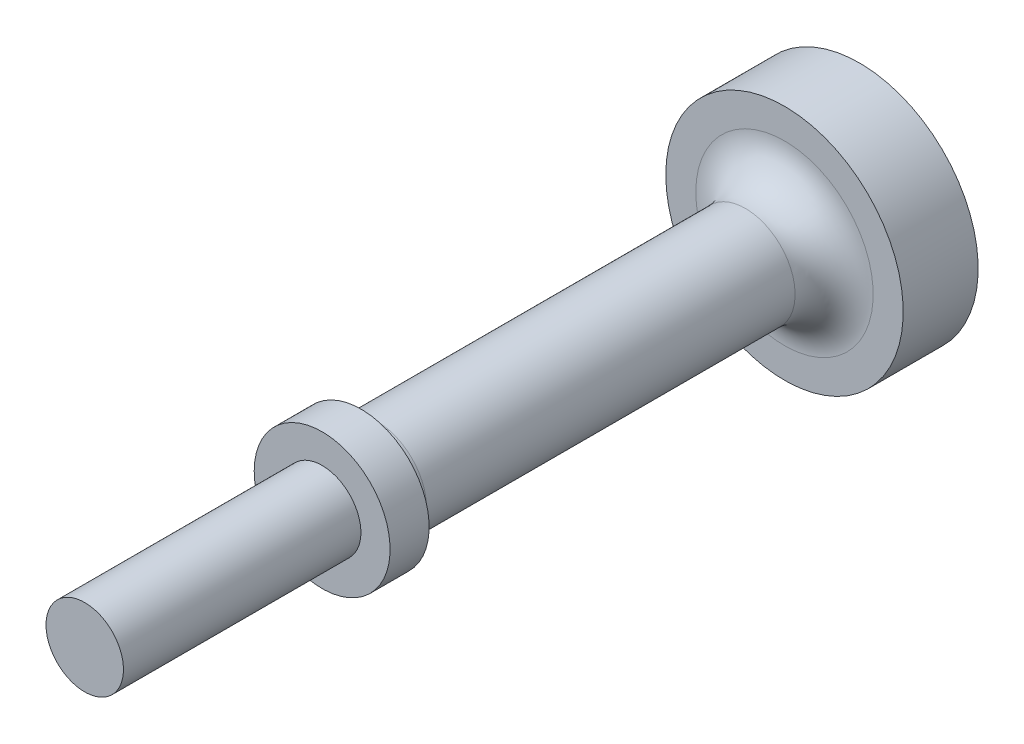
from build123d import *


with BuildPart() as part:
    # Sketch1 → Revolve1 (revolve)
    with BuildSketch(Plane(origin=(0, 0, 0), x_dir=(1, 0, 0), z_dir=(0, 1, 0)), mode=Mode.PRIVATE) as revolve1_sk:
        with BuildLine():
            Line((0, 62.992), (9.652, 62.992))
            Line((9.652, 62.992), (9.652, 56.896))
            Line((9.652, 56.896), (7.2136, 56.896))
            ThreePointArc((7.2136, 56.896), (4.96853597, 55.96606403), (4.0386, 53.721))
            Line((4.0386, 53.721), (4.0386, 23.749))
            ThreePointArc((4.0386, 23.749), (4.410574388, 22.850974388), (5.3086, 22.479))
            Line((5.3086, 22.479), (5.5245, 22.479))
            Line((5.5245, 22.479), (5.5245, 19.304))
            Line((5.5245, 19.304), (3.1496, 19.304))
            Line((3.1496, 19.304), (3.1496, 0))
            Line((3.1496, 0), (0, 0))
            Line((0, 0), (0, 62.992))
        make_face()
    revolve(revolve1_sk.sketch.rotate(Axis((0, 0, -62.992), (0, 0, 1)), 180), axis=Axis((0, 0, -62.992), (0, 0, 1)))


solid = part.part
